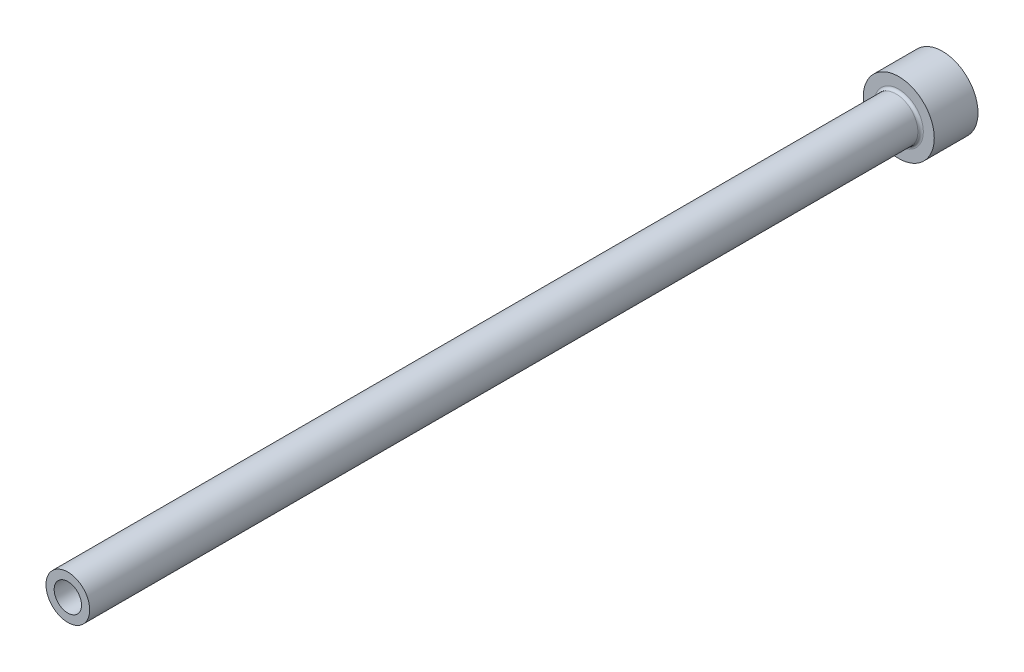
ISO-10303-21;
HEADER;
FILE_DESCRIPTION(('STEP AP214'),'2;1');
FILE_NAME('part.step','',(''),(''),'','','');
FILE_SCHEMA(('AUTOMOTIVE_DESIGN { 1 0 10303 214 1 1 1 1 }'));
ENDSEC;
DATA;
#1=APPLICATION_CONTEXT('core data for automotive mechanical design processes');
#2=APPLICATION_PROTOCOL_DEFINITION('international standard','automotive_design',2000,#1);
#3=PRODUCT_CONTEXT('',#1,'mechanical');
#4=PRODUCT('Part','Part','',(#3));
#5=PRODUCT_RELATED_PRODUCT_CATEGORY('part','',(#4));
#6=PRODUCT_DEFINITION_FORMATION('','',#4);
#7=PRODUCT_DEFINITION_CONTEXT('part definition',#1,'design');
#8=PRODUCT_DEFINITION('design','',#6,#7);
#9=PRODUCT_DEFINITION_SHAPE('','',#8);
#10=(LENGTH_UNIT() NAMED_UNIT(*) SI_UNIT(.MILLI.,.METRE.));
#11=(NAMED_UNIT(*) PLANE_ANGLE_UNIT() SI_UNIT($,.RADIAN.));
#12=(NAMED_UNIT(*) SI_UNIT($,.STERADIAN.) SOLID_ANGLE_UNIT());
#13=UNCERTAINTY_MEASURE_WITH_UNIT(LENGTH_MEASURE(1.E-05),#10,'distance_accuracy_value','');
#14=(GEOMETRIC_REPRESENTATION_CONTEXT(3) GLOBAL_UNCERTAINTY_ASSIGNED_CONTEXT((#13)) GLOBAL_UNIT_ASSIGNED_CONTEXT((#10,
#11,#12)) REPRESENTATION_CONTEXT('',''));
#15=CARTESIAN_POINT('',(0.,0.,0.));
#16=DIRECTION('',(0.,0.,1.));
#17=DIRECTION('',(1.,0.,0.));
#18=AXIS2_PLACEMENT_3D('',#15,#16,#17);
#19=CARTESIAN_POINT('',(0.,0.,160.));
#20=DIRECTION('',(0.,0.,-1.));
#21=DIRECTION('',(-1.,0.,0.));
#22=AXIS2_PLACEMENT_3D('',#19,#20,#21);
#23=PLANE('',#22);
#24=CARTESIAN_POINT('',(0.,0.,160.));
#25=DIRECTION('',(0.,0.,1.));
#26=DIRECTION('',(1.,0.,0.));
#27=AXIS2_PLACEMENT_3D('',#24,#25,#26);
#28=CIRCLE('',#27,2.49999999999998);
#29=CARTESIAN_POINT('',(2.49999999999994,0.,160.));
#30=VERTEX_POINT('',#29);
#31=EDGE_CURVE('E63',#30,#30,#28,.T.);
#32=ORIENTED_EDGE('',*,*,#31,.F.);
#33=EDGE_LOOP('',(#32));
#34=FACE_BOUND('',#33,.T.);
#35=CARTESIAN_POINT('',(0.,0.,160.));
#36=DIRECTION('',(0.,0.,1.));
#37=DIRECTION('',(1.,0.,0.));
#38=AXIS2_PLACEMENT_3D('',#35,#36,#37);
#39=CIRCLE('',#38,3.99999999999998);
#40=CARTESIAN_POINT('',(3.99999999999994,0.,160.));
#41=VERTEX_POINT('',#40);
#42=EDGE_CURVE('E54',#41,#41,#39,.T.);
#43=ORIENTED_EDGE('',*,*,#42,.T.);
#44=EDGE_LOOP('',(#43));
#45=FACE_BOUND('',#44,.T.);
#46=ADVANCED_FACE('F34',(#34,#45),#23,.F.);
#47=CARTESIAN_POINT('',(0.,0.,160.));
#48=DIRECTION('',(0.,0.,1.));
#49=DIRECTION('',(1.,0.,0.));
#50=AXIS2_PLACEMENT_3D('',#47,#48,#49);
#51=CYLINDRICAL_SURFACE('',#50,3.99999999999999);
#52=CARTESIAN_POINT('',(0.,0.,8.50000000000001));
#53=DIRECTION('',(0.,0.,1.));
#54=DIRECTION('',(1.,0.,0.));
#55=AXIS2_PLACEMENT_3D('',#52,#53,#54);
#56=CIRCLE('',#55,3.99999999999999);
#57=CARTESIAN_POINT('',(3.99999999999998,0.,8.50000000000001));
#58=VERTEX_POINT('',#57);
#59=EDGE_CURVE('E49',#58,#58,#56,.T.);
#60=ORIENTED_EDGE('',*,*,#59,.T.);
#61=EDGE_LOOP('',(#60));
#62=FACE_BOUND('',#61,.T.);
#63=ORIENTED_EDGE('',*,*,#42,.F.);
#64=EDGE_LOOP('',(#63));
#65=FACE_BOUND('',#64,.T.);
#66=ADVANCED_FACE('F92',(#62,#65),#51,.T.);
#67=CARTESIAN_POINT('',(0.,0.,8.));
#68=DIRECTION('',(0.,0.,1.));
#69=DIRECTION('',(1.,0.,0.));
#70=AXIS2_PLACEMENT_3D('',#67,#68,#69);
#71=PLANE('',#70);
#72=CARTESIAN_POINT('',(0.,0.,8.));
#73=DIRECTION('',(0.,0.,1.));
#74=DIRECTION('',(1.,0.,0.));
#75=AXIS2_PLACEMENT_3D('',#72,#73,#74);
#76=CIRCLE('',#75,4.49999999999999);
#77=CARTESIAN_POINT('',(4.49999999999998,0.,8.));
#78=VERTEX_POINT('',#77);
#79=EDGE_CURVE('E45',#78,#78,#76,.F.);
#80=ORIENTED_EDGE('',*,*,#79,.T.);
#81=EDGE_LOOP('',(#80));
#82=FACE_BOUND('',#81,.T.);
#83=CARTESIAN_POINT('',(0.,0.,8.00000000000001));
#84=DIRECTION('',(0.,0.,1.));
#85=DIRECTION('',(1.,0.,0.));
#86=AXIS2_PLACEMENT_3D('',#83,#84,#85);
#87=CIRCLE('',#86,6.5);
#88=CARTESIAN_POINT('',(6.49999999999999,0.,8.00000000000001));
#89=VERTEX_POINT('',#88);
#90=EDGE_CURVE('E57',#89,#89,#87,.T.);
#91=ORIENTED_EDGE('',*,*,#90,.T.);
#92=EDGE_LOOP('',(#91));
#93=FACE_BOUND('',#92,.T.);
#94=ADVANCED_FACE('F98',(#82,#93),#71,.T.);
#95=CARTESIAN_POINT('',(0.,0.,160.));
#96=DIRECTION('',(0.,0.,1.));
#97=DIRECTION('',(1.,0.,0.));
#98=AXIS2_PLACEMENT_3D('',#95,#96,#97);
#99=CYLINDRICAL_SURFACE('',#98,6.5);
#100=ORIENTED_EDGE('',*,*,#90,.F.);
#101=EDGE_LOOP('',(#100));
#102=FACE_BOUND('',#101,.T.);
#103=CARTESIAN_POINT('',(0.,0.,0.));
#104=DIRECTION('',(0.,0.,1.));
#105=DIRECTION('',(1.,0.,0.));
#106=AXIS2_PLACEMENT_3D('',#103,#104,#105);
#107=CIRCLE('',#106,6.49999999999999);
#108=CARTESIAN_POINT('',(6.49999999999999,0.,0.));
#109=VERTEX_POINT('',#108);
#110=EDGE_CURVE('E60',#109,#109,#107,.T.);
#111=ORIENTED_EDGE('',*,*,#110,.T.);
#112=EDGE_LOOP('',(#111));
#113=FACE_BOUND('',#112,.T.);
#114=ADVANCED_FACE('F89',(#102,#113),#99,.T.);
#115=CARTESIAN_POINT('',(0.,0.,0.));
#116=DIRECTION('',(0.,0.,1.));
#117=DIRECTION('',(1.,0.,0.));
#118=AXIS2_PLACEMENT_3D('',#115,#116,#117);
#119=PLANE('',#118);
#120=CARTESIAN_POINT('',(0.,0.,0.));
#121=DIRECTION('',(0.,0.,1.));
#122=DIRECTION('',(1.,0.,0.));
#123=AXIS2_PLACEMENT_3D('',#120,#121,#122);
#124=CIRCLE('',#123,3.25000000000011);
#125=CARTESIAN_POINT('',(3.25000000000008,0.,0.));
#126=VERTEX_POINT('',#125);
#127=EDGE_CURVE('E41',#126,#126,#124,.T.);
#128=ORIENTED_EDGE('',*,*,#127,.T.);
#129=EDGE_LOOP('',(#128));
#130=FACE_BOUND('',#129,.T.);
#131=ORIENTED_EDGE('',*,*,#110,.F.);
#132=EDGE_LOOP('',(#131));
#133=FACE_BOUND('',#132,.T.);
#134=ADVANCED_FACE('F83',(#130,#133),#119,.F.);
#135=CARTESIAN_POINT('',(0.,0.,160.));
#136=DIRECTION('',(0.,0.,1.));
#137=DIRECTION('',(1.,0.,0.));
#138=AXIS2_PLACEMENT_3D('',#135,#136,#137);
#139=CYLINDRICAL_SURFACE('',#138,2.49999999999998);
#140=ORIENTED_EDGE('',*,*,#31,.T.);
#141=EDGE_LOOP('',(#140));
#142=FACE_BOUND('',#141,.T.);
#143=CARTESIAN_POINT('',(0.,0.,85.));
#144=DIRECTION('',(0.,0.,1.));
#145=DIRECTION('',(1.,0.,0.));
#146=AXIS2_PLACEMENT_3D('',#143,#144,#145);
#147=CIRCLE('',#146,2.49999999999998);
#148=CARTESIAN_POINT('',(2.49999999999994,0.,85.));
#149=VERTEX_POINT('',#148);
#150=EDGE_CURVE('E66',#149,#149,#147,.T.);
#151=ORIENTED_EDGE('',*,*,#150,.F.);
#152=EDGE_LOOP('',(#151));
#153=FACE_BOUND('',#152,.T.);
#154=ADVANCED_FACE('F78',(#142,#153),#139,.F.);
#155=CARTESIAN_POINT('',(0.,0.,85.));
#156=DIRECTION('',(0.,0.,-1.));
#157=DIRECTION('',(-1.,0.,0.));
#158=AXIS2_PLACEMENT_3D('',#155,#156,#157);
#159=CONICAL_SURFACE('',#158,2.49999999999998,0.523598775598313);
#160=CARTESIAN_POINT('',(0.,0.,84.5669872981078));
#161=DIRECTION('',(0.,0.,1.));
#162=DIRECTION('',(1.,0.,0.));
#163=AXIS2_PLACEMENT_3D('',#160,#161,#162);
#164=CIRCLE('',#163,2.74999999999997);
#165=CARTESIAN_POINT('',(2.74999999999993,0.,84.5669872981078));
#166=VERTEX_POINT('',#165);
#167=EDGE_CURVE('E69',#166,#166,#164,.T.);
#168=ORIENTED_EDGE('',*,*,#167,.F.);
#169=EDGE_LOOP('',(#168));
#170=FACE_BOUND('',#169,.T.);
#171=ORIENTED_EDGE('',*,*,#150,.T.);
#172=EDGE_LOOP('',(#171));
#173=FACE_BOUND('',#172,.T.);
#174=ADVANCED_FACE('F75',(#170,#173),#159,.F.);
#175=CARTESIAN_POINT('',(0.,0.,160.));
#176=DIRECTION('',(0.,0.,1.));
#177=DIRECTION('',(1.,0.,0.));
#178=AXIS2_PLACEMENT_3D('',#175,#176,#177);
#179=CYLINDRICAL_SURFACE('',#178,2.75000000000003);
#180=CARTESIAN_POINT('',(0.,0.,0.500000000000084));
#181=DIRECTION('',(0.,0.,1.));
#182=DIRECTION('',(1.,0.,0.));
#183=AXIS2_PLACEMENT_3D('',#180,#181,#182);
#184=CIRCLE('',#183,2.75000000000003);
#185=CARTESIAN_POINT('',(2.74999999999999,0.,0.500000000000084));
#186=VERTEX_POINT('',#185);
#187=EDGE_CURVE('E10',#186,#186,#184,.F.);
#188=ORIENTED_EDGE('',*,*,#187,.T.);
#189=EDGE_LOOP('',(#188));
#190=FACE_BOUND('',#189,.T.);
#191=ORIENTED_EDGE('',*,*,#167,.T.);
#192=EDGE_LOOP('',(#191));
#193=FACE_BOUND('',#192,.T.);
#194=ADVANCED_FACE('F73',(#190,#193),#179,.F.);
#195=CARTESIAN_POINT('',(0.,0.,8.50000000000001));
#196=DIRECTION('',(0.,0.,1.));
#197=DIRECTION('',(1.,0.,0.));
#198=AXIS2_PLACEMENT_3D('',#195,#196,#197);
#199=TOROIDAL_SURFACE('',#198,4.49999999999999,0.5);
#200=ORIENTED_EDGE('',*,*,#79,.F.);
#201=EDGE_LOOP('',(#200));
#202=FACE_BOUND('',#201,.T.);
#203=ORIENTED_EDGE('',*,*,#59,.F.);
#204=EDGE_LOOP('',(#203));
#205=FACE_BOUND('',#204,.T.);
#206=ADVANCED_FACE('F104',(#202,#205),#199,.F.);
#207=CARTESIAN_POINT('',(0.,0.,0.));
#208=DIRECTION('',(0.,0.,-1.));
#209=DIRECTION('',(-1.,0.,0.));
#210=AXIS2_PLACEMENT_3D('',#207,#208,#209);
#211=CONICAL_SURFACE('',#210,3.25000000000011,0.785398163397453);
#212=ORIENTED_EDGE('',*,*,#187,.F.);
#213=EDGE_LOOP('',(#212));
#214=FACE_BOUND('',#213,.T.);
#215=ORIENTED_EDGE('',*,*,#127,.F.);
#216=EDGE_LOOP('',(#215));
#217=FACE_BOUND('',#216,.T.);
#218=ADVANCED_FACE('F36',(#214,#217),#211,.F.);
#219=CLOSED_SHELL('',(#46,#66,#94,#114,#134,#154,#174,#194,#206,#218));
#220=MANIFOLD_SOLID_BREP('B2',#219);
#221=ADVANCED_BREP_SHAPE_REPRESENTATION('',(#18,#220),#14);
#222=SHAPE_DEFINITION_REPRESENTATION(#9,#221);
ENDSEC;
END-ISO-10303-21;
